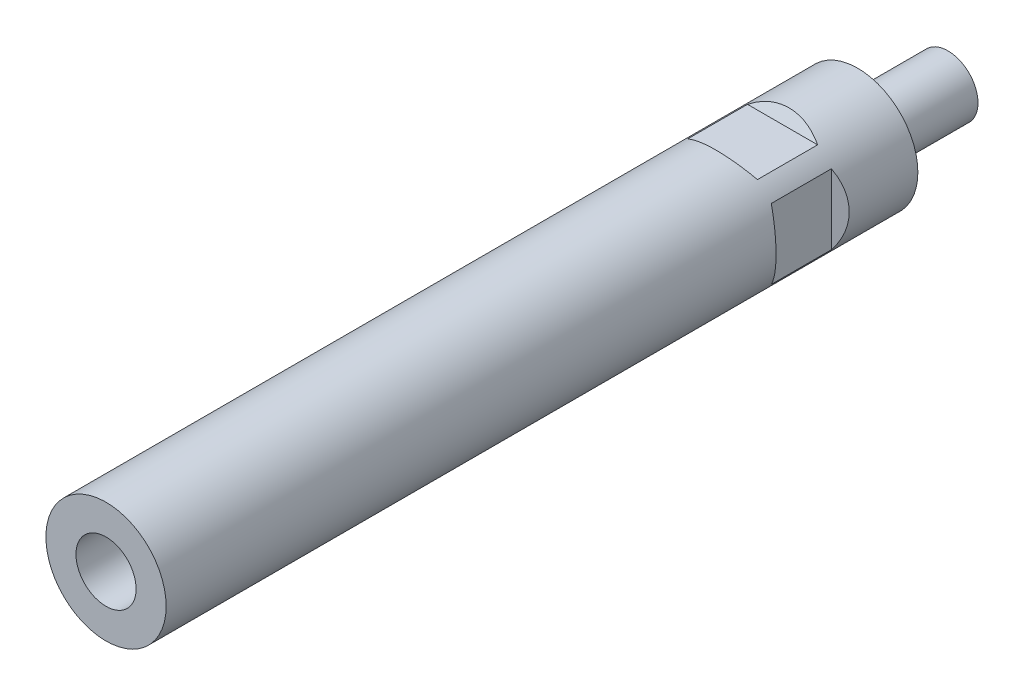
ISO-10303-21;
HEADER;
FILE_DESCRIPTION(('STEP AP214'),'2;1');
FILE_NAME('part.step','',(''),(''),'','','');
FILE_SCHEMA(('AUTOMOTIVE_DESIGN { 1 0 10303 214 1 1 1 1 }'));
ENDSEC;
DATA;
#1=APPLICATION_CONTEXT('core data for automotive mechanical design processes');
#2=APPLICATION_PROTOCOL_DEFINITION('international standard','automotive_design',2000,#1);
#3=PRODUCT_CONTEXT('',#1,'mechanical');
#4=PRODUCT('Part','Part','',(#3));
#5=PRODUCT_RELATED_PRODUCT_CATEGORY('part','',(#4));
#6=PRODUCT_DEFINITION_FORMATION('','',#4);
#7=PRODUCT_DEFINITION_CONTEXT('part definition',#1,'design');
#8=PRODUCT_DEFINITION('design','',#6,#7);
#9=PRODUCT_DEFINITION_SHAPE('','',#8);
#10=(LENGTH_UNIT() NAMED_UNIT(*) SI_UNIT(.MILLI.,.METRE.));
#11=(NAMED_UNIT(*) PLANE_ANGLE_UNIT() SI_UNIT($,.RADIAN.));
#12=(NAMED_UNIT(*) SI_UNIT($,.STERADIAN.) SOLID_ANGLE_UNIT());
#13=UNCERTAINTY_MEASURE_WITH_UNIT(LENGTH_MEASURE(1.E-05),#10,'distance_accuracy_value','');
#14=(GEOMETRIC_REPRESENTATION_CONTEXT(3) GLOBAL_UNCERTAINTY_ASSIGNED_CONTEXT((#13)) GLOBAL_UNIT_ASSIGNED_CONTEXT((#10,
#11,#12)) REPRESENTATION_CONTEXT('',''));
#15=CARTESIAN_POINT('',(0.,0.,0.));
#16=DIRECTION('',(0.,0.,1.));
#17=DIRECTION('',(1.,0.,0.));
#18=AXIS2_PLACEMENT_3D('',#15,#16,#17);
#19=CARTESIAN_POINT('',(0.,0.,8.));
#20=DIRECTION('',(0.,0.,1.));
#21=DIRECTION('',(0.,-1.,0.));
#22=AXIS2_PLACEMENT_3D('',#19,#20,#21);
#23=CYLINDRICAL_SURFACE('',#22,4.);
#24=CARTESIAN_POINT('',(0.,0.,-12.));
#25=DIRECTION('',(0.,0.,1.));
#26=DIRECTION('',(0.,-1.,0.));
#27=AXIS2_PLACEMENT_3D('',#24,#25,#26);
#28=CIRCLE('',#27,4.);
#29=CARTESIAN_POINT('',(0.,-4.,-12.));
#30=VERTEX_POINT('',#29);
#31=EDGE_CURVE('E22',#30,#30,#28,.F.);
#32=ORIENTED_EDGE('',*,*,#31,.F.);
#33=EDGE_LOOP('',(#32));
#34=FACE_BOUND('',#33,.T.);
#35=CARTESIAN_POINT('',(0.,0.,0.));
#36=DIRECTION('',(0.,0.,1.));
#37=DIRECTION('',(1.,0.,0.));
#38=AXIS2_PLACEMENT_3D('',#35,#36,#37);
#39=CIRCLE('',#38,4.);
#40=CARTESIAN_POINT('',(4.,0.,0.));
#41=VERTEX_POINT('',#40);
#42=EDGE_CURVE('E9',#41,#41,#39,.T.);
#43=ORIENTED_EDGE('',*,*,#42,.F.);
#44=EDGE_LOOP('',(#43));
#45=FACE_BOUND('',#44,.T.);
#46=ADVANCED_FACE('F14',(#34,#45),#23,.T.);
#47=CARTESIAN_POINT('',(0.,0.,-12.));
#48=DIRECTION('',(0.,0.,1.));
#49=DIRECTION('',(0.,-1.,0.));
#50=AXIS2_PLACEMENT_3D('',#47,#48,#49);
#51=PLANE('',#50);
#52=ORIENTED_EDGE('',*,*,#31,.T.);
#53=EDGE_LOOP('',(#52));
#54=FACE_BOUND('',#53,.T.);
#55=ADVANCED_FACE('F16',(#54),#51,.F.);
#56=CARTESIAN_POINT('',(3.4,0.,80.));
#57=DIRECTION('',(0.,0.,-1.));
#58=DIRECTION('',(-1.,0.,0.));
#59=AXIS2_PLACEMENT_3D('',#56,#57,#58);
#60=PLANE('',#59);
#61=CARTESIAN_POINT('',(0.,0.,80.));
#62=DIRECTION('',(0.,0.,1.));
#63=DIRECTION('',(1.,0.,0.));
#64=AXIS2_PLACEMENT_3D('',#61,#62,#63);
#65=CIRCLE('',#64,4.);
#66=CARTESIAN_POINT('',(4.,0.,80.));
#67=VERTEX_POINT('',#66);
#68=EDGE_CURVE('E251',#67,#67,#65,.T.);
#69=ORIENTED_EDGE('',*,*,#68,.T.);
#70=EDGE_LOOP('',(#69));
#71=FACE_BOUND('',#70,.T.);
#72=ADVANCED_FACE('F125',(#71),#60,.F.);
#73=CARTESIAN_POINT('',(0.,0.,100.));
#74=DIRECTION('',(0.,0.,1.));
#75=DIRECTION('',(1.,0.,0.));
#76=AXIS2_PLACEMENT_3D('',#73,#74,#75);
#77=CYLINDRICAL_SURFACE('',#76,4.);
#78=ORIENTED_EDGE('',*,*,#68,.F.);
#79=EDGE_LOOP('',(#78));
#80=FACE_BOUND('',#79,.T.);
#81=CARTESIAN_POINT('',(0.,0.,100.));
#82=DIRECTION('',(0.,0.,1.));
#83=DIRECTION('',(1.,0.,0.));
#84=AXIS2_PLACEMENT_3D('',#81,#82,#83);
#85=CIRCLE('',#84,4.);
#86=CARTESIAN_POINT('',(4.,0.,100.));
#87=VERTEX_POINT('',#86);
#88=EDGE_CURVE('E96',#87,#87,#85,.T.);
#89=ORIENTED_EDGE('',*,*,#88,.T.);
#90=EDGE_LOOP('',(#89));
#91=FACE_BOUND('',#90,.T.);
#92=ADVANCED_FACE('F127',(#80,#91),#77,.F.);
#93=CARTESIAN_POINT('',(0.,0.,100.));
#94=DIRECTION('',(0.,0.,1.));
#95=DIRECTION('',(1.,0.,0.));
#96=AXIS2_PLACEMENT_3D('',#93,#94,#95);
#97=PLANE('',#96);
#98=ORIENTED_EDGE('',*,*,#88,.F.);
#99=EDGE_LOOP('',(#98));
#100=FACE_BOUND('',#99,.T.);
#101=CARTESIAN_POINT('',(0.,0.,100.));
#102=DIRECTION('',(0.,0.,1.));
#103=DIRECTION('',(1.,0.,0.));
#104=AXIS2_PLACEMENT_3D('',#101,#102,#103);
#105=CIRCLE('',#104,8.);
#106=CARTESIAN_POINT('',(8.,0.,100.));
#107=VERTEX_POINT('',#106);
#108=EDGE_CURVE('E239',#107,#107,#105,.T.);
#109=ORIENTED_EDGE('',*,*,#108,.T.);
#110=EDGE_LOOP('',(#109));
#111=FACE_BOUND('',#110,.T.);
#112=ADVANCED_FACE('F134',(#100,#111),#97,.T.);
#113=CARTESIAN_POINT('',(6.5,-8.,18.));
#114=DIRECTION('',(-0.5,0.,0.866025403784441));
#115=DIRECTION('',(0.866025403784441,0.,0.5));
#116=AXIS2_PLACEMENT_3D('',#113,#114,#115);
#117=PLANE('',#116);
#118=DIRECTION('',(0.,1.,0.));
#119=VECTOR('',#118,1.);
#120=CARTESIAN_POINT('',(6.5,-8.,18.));
#121=LINE('',#120,#119);
#122=CARTESIAN_POINT('',(6.5,-4.6636895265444,18.));
#123=VERTEX_POINT('',#122);
#124=CARTESIAN_POINT('',(6.5,4.6636895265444,18.));
#125=VERTEX_POINT('',#124);
#126=EDGE_CURVE('E183',#123,#125,#121,.T.);
#127=ORIENTED_EDGE('',*,*,#126,.T.);
#128=CARTESIAN_POINT('',(0.,0.,14.2472232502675));
#129=DIRECTION('',(-0.5,0.,0.866025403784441));
#130=DIRECTION('',(-0.866025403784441,0.,-0.5));
#131=AXIS2_PLACEMENT_3D('',#128,#129,#130);
#132=ELLIPSE('',#131,9.23760430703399,8.);
#133=EDGE_CURVE('E35',#123,#125,#132,.T.);
#134=ORIENTED_EDGE('',*,*,#133,.F.);
#135=EDGE_LOOP('',(#127,#134));
#136=FACE_BOUND('',#135,.T.);
#137=ADVANCED_FACE('F175',(#136),#117,.F.);
#138=CARTESIAN_POINT('',(6.5,-8.,18.));
#139=DIRECTION('',(-1.,0.,0.));
#140=DIRECTION('',(0.,0.,1.));
#141=AXIS2_PLACEMENT_3D('',#138,#139,#140);
#142=PLANE('',#141);
#143=ORIENTED_EDGE('',*,*,#126,.F.);
#144=DIRECTION('',(0.,0.,-1.));
#145=VECTOR('',#144,1.);
#146=CARTESIAN_POINT('',(6.5,-4.6636895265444,100.));
#147=LINE('',#146,#145);
#148=CARTESIAN_POINT('',(6.5,-4.66368952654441,10.));
#149=VERTEX_POINT('',#148);
#150=EDGE_CURVE('E191',#149,#123,#147,.F.);
#151=ORIENTED_EDGE('',*,*,#150,.F.);
#152=DIRECTION('',(0.,1.,0.));
#153=VECTOR('',#152,1.);
#154=CARTESIAN_POINT('',(6.5,-8.,10.));
#155=LINE('',#154,#153);
#156=CARTESIAN_POINT('',(6.5,4.6636895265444,10.));
#157=VERTEX_POINT('',#156);
#158=EDGE_CURVE('E187',#149,#157,#155,.T.);
#159=ORIENTED_EDGE('',*,*,#158,.T.);
#160=DIRECTION('',(0.,0.,-1.));
#161=VECTOR('',#160,1.);
#162=CARTESIAN_POINT('',(6.5,4.6636895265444,100.));
#163=LINE('',#162,#161);
#164=EDGE_CURVE('E29',#125,#157,#163,.T.);
#165=ORIENTED_EDGE('',*,*,#164,.F.);
#166=EDGE_LOOP('',(#143,#151,#159,#165));
#167=FACE_BOUND('',#166,.T.);
#168=ADVANCED_FACE('F172',(#167),#142,.F.);
#169=CARTESIAN_POINT('',(6.5,-8.,10.));
#170=DIRECTION('',(-0.5,0.,-0.866025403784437));
#171=DIRECTION('',(-0.866025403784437,0.,0.5));
#172=AXIS2_PLACEMENT_3D('',#169,#170,#171);
#173=PLANE('',#172);
#174=CARTESIAN_POINT('',(0.,0.,13.7527767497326));
#175=DIRECTION('',(-0.5,0.,-0.866025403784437));
#176=DIRECTION('',(0.866025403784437,0.,-0.5));
#177=AXIS2_PLACEMENT_3D('',#174,#175,#176);
#178=ELLIPSE('',#177,9.23760430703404,8.);
#179=EDGE_CURVE('E195',#157,#149,#178,.T.);
#180=ORIENTED_EDGE('',*,*,#179,.F.);
#181=ORIENTED_EDGE('',*,*,#158,.F.);
#182=EDGE_LOOP('',(#180,#181));
#183=FACE_BOUND('',#182,.T.);
#184=ADVANCED_FACE('F167',(#183),#173,.F.);
#185=CARTESIAN_POINT('',(-6.5,-8.,10.));
#186=DIRECTION('',(0.5,0.,-0.866025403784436));
#187=DIRECTION('',(-0.866025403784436,0.,-0.5));
#188=AXIS2_PLACEMENT_3D('',#185,#186,#187);
#189=PLANE('',#188);
#190=CARTESIAN_POINT('',(0.,0.,13.7527767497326));
#191=DIRECTION('',(0.5,0.,-0.866025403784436));
#192=DIRECTION('',(-0.866025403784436,0.,-0.5));
#193=AXIS2_PLACEMENT_3D('',#190,#191,#192);
#194=ELLIPSE('',#193,9.23760430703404,8.);
#195=CARTESIAN_POINT('',(-6.5,-4.6636895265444,10.));
#196=VERTEX_POINT('',#195);
#197=CARTESIAN_POINT('',(-6.5,4.6636895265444,10.));
#198=VERTEX_POINT('',#197);
#199=EDGE_CURVE('E193',#196,#198,#194,.T.);
#200=ORIENTED_EDGE('',*,*,#199,.F.);
#201=DIRECTION('',(0.,1.,0.));
#202=VECTOR('',#201,1.);
#203=CARTESIAN_POINT('',(-6.5,-8.,10.));
#204=LINE('',#203,#202);
#205=EDGE_CURVE('E227',#196,#198,#204,.T.);
#206=ORIENTED_EDGE('',*,*,#205,.T.);
#207=EDGE_LOOP('',(#200,#206));
#208=FACE_BOUND('',#207,.T.);
#209=ADVANCED_FACE('F163',(#208),#189,.F.);
#210=CARTESIAN_POINT('',(-6.5,-8.,18.));
#211=DIRECTION('',(0.5,0.,0.86602540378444));
#212=DIRECTION('',(0.86602540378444,0.,-0.5));
#213=AXIS2_PLACEMENT_3D('',#210,#211,#212);
#214=PLANE('',#213);
#215=DIRECTION('',(0.,1.,0.));
#216=VECTOR('',#215,1.);
#217=CARTESIAN_POINT('',(-6.5,-8.,18.));
#218=LINE('',#217,#216);
#219=CARTESIAN_POINT('',(-6.5,-4.66368952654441,18.));
#220=VERTEX_POINT('',#219);
#221=CARTESIAN_POINT('',(-6.5,4.6636895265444,18.));
#222=VERTEX_POINT('',#221);
#223=EDGE_CURVE('E231',#220,#222,#218,.T.);
#224=ORIENTED_EDGE('',*,*,#223,.F.);
#225=CARTESIAN_POINT('',(0.,0.,14.2472232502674));
#226=DIRECTION('',(0.5,0.,0.86602540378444));
#227=DIRECTION('',(0.86602540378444,0.,-0.5));
#228=AXIS2_PLACEMENT_3D('',#225,#226,#227);
#229=ELLIPSE('',#228,9.237604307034,8.);
#230=EDGE_CURVE('E206',#222,#220,#229,.T.);
#231=ORIENTED_EDGE('',*,*,#230,.F.);
#232=EDGE_LOOP('',(#224,#231));
#233=FACE_BOUND('',#232,.T.);
#234=ADVANCED_FACE('F160',(#233),#214,.F.);
#235=CARTESIAN_POINT('',(-6.5,-8.,18.));
#236=DIRECTION('',(1.,0.,0.));
#237=DIRECTION('',(0.,0.,-1.));
#238=AXIS2_PLACEMENT_3D('',#235,#236,#237);
#239=PLANE('',#238);
#240=ORIENTED_EDGE('',*,*,#223,.T.);
#241=DIRECTION('',(0.,0.,-1.));
#242=VECTOR('',#241,1.);
#243=CARTESIAN_POINT('',(-6.5,4.66368952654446,100.));
#244=LINE('',#243,#242);
#245=EDGE_CURVE('E200',#198,#222,#244,.F.);
#246=ORIENTED_EDGE('',*,*,#245,.F.);
#247=ORIENTED_EDGE('',*,*,#205,.F.);
#248=DIRECTION('',(0.,0.,-1.));
#249=VECTOR('',#248,1.);
#250=CARTESIAN_POINT('',(-6.5,-4.66368952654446,100.));
#251=LINE('',#250,#249);
#252=EDGE_CURVE('E203',#220,#196,#251,.T.);
#253=ORIENTED_EDGE('',*,*,#252,.F.);
#254=EDGE_LOOP('',(#240,#246,#247,#253));
#255=FACE_BOUND('',#254,.T.);
#256=ADVANCED_FACE('F158',(#255),#239,.F.);
#257=CARTESIAN_POINT('',(8.,6.5,18.));
#258=DIRECTION('',(0.,-0.5,0.86602540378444));
#259=DIRECTION('',(0.,-0.866025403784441,-0.5));
#260=AXIS2_PLACEMENT_3D('',#257,#258,#259);
#261=PLANE('',#260);
#262=DIRECTION('',(-1.,0.,0.));
#263=VECTOR('',#262,1.);
#264=CARTESIAN_POINT('',(8.,6.5,18.));
#265=LINE('',#264,#263);
#266=CARTESIAN_POINT('',(4.66368952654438,6.5,18.));
#267=VERTEX_POINT('',#266);
#268=CARTESIAN_POINT('',(-4.66368952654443,6.5,18.));
#269=VERTEX_POINT('',#268);
#270=EDGE_CURVE('E225',#267,#269,#265,.T.);
#271=ORIENTED_EDGE('',*,*,#270,.T.);
#272=CARTESIAN_POINT('',(0.,0.,14.2472232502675));
#273=DIRECTION('',(0.,-0.5,0.86602540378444));
#274=DIRECTION('',(0.,-0.866025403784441,-0.5));
#275=AXIS2_PLACEMENT_3D('',#272,#273,#274);
#276=ELLIPSE('',#275,9.237604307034,8.);
#277=EDGE_CURVE('E214',#267,#269,#276,.T.);
#278=ORIENTED_EDGE('',*,*,#277,.F.);
#279=EDGE_LOOP('',(#271,#278));
#280=FACE_BOUND('',#279,.T.);
#281=ADVANCED_FACE('F151',(#280),#261,.F.);
#282=CARTESIAN_POINT('',(8.,6.5,18.));
#283=DIRECTION('',(0.,-1.,0.));
#284=DIRECTION('',(1.,0.,0.));
#285=AXIS2_PLACEMENT_3D('',#282,#283,#284);
#286=PLANE('',#285);
#287=ORIENTED_EDGE('',*,*,#270,.F.);
#288=DIRECTION('',(0.,0.,-1.));
#289=VECTOR('',#288,1.);
#290=CARTESIAN_POINT('',(4.66368952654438,6.5,100.));
#291=LINE('',#290,#289);
#292=CARTESIAN_POINT('',(4.66368952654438,6.5,10.));
#293=VERTEX_POINT('',#292);
#294=EDGE_CURVE('E88',#293,#267,#291,.F.);
#295=ORIENTED_EDGE('',*,*,#294,.F.);
#296=DIRECTION('',(-1.,0.,0.));
#297=VECTOR('',#296,1.);
#298=CARTESIAN_POINT('',(8.,6.5,10.));
#299=LINE('',#298,#297);
#300=CARTESIAN_POINT('',(-4.66368952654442,6.5,10.));
#301=VERTEX_POINT('',#300);
#302=EDGE_CURVE('E223',#293,#301,#299,.T.);
#303=ORIENTED_EDGE('',*,*,#302,.T.);
#304=DIRECTION('',(0.,0.,-1.));
#305=VECTOR('',#304,1.);
#306=CARTESIAN_POINT('',(-4.66368952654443,6.5,100.));
#307=LINE('',#306,#305);
#308=EDGE_CURVE('E211',#269,#301,#307,.T.);
#309=ORIENTED_EDGE('',*,*,#308,.F.);
#310=EDGE_LOOP('',(#287,#295,#303,#309));
#311=FACE_BOUND('',#310,.T.);
#312=ADVANCED_FACE('F148',(#311),#286,.F.);
#313=CARTESIAN_POINT('',(8.,6.5,10.));
#314=DIRECTION('',(0.,-0.5,-0.866025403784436));
#315=DIRECTION('',(0.,0.866025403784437,-0.5));
#316=AXIS2_PLACEMENT_3D('',#313,#314,#315);
#317=PLANE('',#316);
#318=CARTESIAN_POINT('',(0.,0.,13.7527767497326));
#319=DIRECTION('',(0.,-0.5,-0.866025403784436));
#320=DIRECTION('',(0.,0.866025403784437,-0.5));
#321=AXIS2_PLACEMENT_3D('',#318,#319,#320);
#322=ELLIPSE('',#321,9.23760430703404,8.);
#323=EDGE_CURVE('E209',#301,#293,#322,.T.);
#324=ORIENTED_EDGE('',*,*,#323,.F.);
#325=ORIENTED_EDGE('',*,*,#302,.F.);
#326=EDGE_LOOP('',(#324,#325));
#327=FACE_BOUND('',#326,.T.);
#328=ADVANCED_FACE('F145',(#327),#317,.F.);
#329=CARTESIAN_POINT('',(8.,-6.5,10.));
#330=DIRECTION('',(0.,0.5,-0.866025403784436));
#331=DIRECTION('',(0.,0.866025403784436,0.5));
#332=AXIS2_PLACEMENT_3D('',#329,#330,#331);
#333=PLANE('',#332);
#334=CARTESIAN_POINT('',(0.,0.,13.7527767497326));
#335=DIRECTION('',(0.,0.5,-0.866025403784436));
#336=DIRECTION('',(0.,-0.866025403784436,-0.5));
#337=AXIS2_PLACEMENT_3D('',#334,#335,#336);
#338=ELLIPSE('',#337,9.23760430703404,8.);
#339=CARTESIAN_POINT('',(4.66368952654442,-6.5,10.));
#340=VERTEX_POINT('',#339);
#341=CARTESIAN_POINT('',(-4.66368952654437,-6.5,10.));
#342=VERTEX_POINT('',#341);
#343=EDGE_CURVE('E79',#340,#342,#338,.T.);
#344=ORIENTED_EDGE('',*,*,#343,.F.);
#345=DIRECTION('',(-1.,0.,0.));
#346=VECTOR('',#345,1.);
#347=CARTESIAN_POINT('',(8.,-6.5,10.));
#348=LINE('',#347,#346);
#349=EDGE_CURVE('E82',#340,#342,#348,.T.);
#350=ORIENTED_EDGE('',*,*,#349,.T.);
#351=EDGE_LOOP('',(#344,#350));
#352=FACE_BOUND('',#351,.T.);
#353=ADVANCED_FACE('F81',(#352),#333,.F.);
#354=CARTESIAN_POINT('',(8.,-6.5,18.));
#355=DIRECTION('',(0.,0.5,0.86602540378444));
#356=DIRECTION('',(0.,-0.86602540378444,0.5));
#357=AXIS2_PLACEMENT_3D('',#354,#355,#356);
#358=PLANE('',#357);
#359=DIRECTION('',(-1.,0.,0.));
#360=VECTOR('',#359,1.);
#361=CARTESIAN_POINT('',(8.,-6.5,18.));
#362=LINE('',#361,#360);
#363=CARTESIAN_POINT('',(4.66368952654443,-6.5,18.));
#364=VERTEX_POINT('',#363);
#365=CARTESIAN_POINT('',(-4.66368952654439,-6.5,18.));
#366=VERTEX_POINT('',#365);
#367=EDGE_CURVE('E95',#364,#366,#362,.T.);
#368=ORIENTED_EDGE('',*,*,#367,.F.);
#369=CARTESIAN_POINT('',(0.,0.,14.2472232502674));
#370=DIRECTION('',(0.,0.5,0.86602540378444));
#371=DIRECTION('',(0.,0.86602540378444,-0.5));
#372=AXIS2_PLACEMENT_3D('',#369,#370,#371);
#373=ELLIPSE('',#372,9.237604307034,8.);
#374=EDGE_CURVE('E101',#366,#364,#373,.T.);
#375=ORIENTED_EDGE('',*,*,#374,.F.);
#376=EDGE_LOOP('',(#368,#375));
#377=FACE_BOUND('',#376,.T.);
#378=ADVANCED_FACE('F139',(#377),#358,.F.);
#379=CARTESIAN_POINT('',(8.,-6.5,18.));
#380=DIRECTION('',(0.,1.,0.));
#381=DIRECTION('',(-1.,0.,0.));
#382=AXIS2_PLACEMENT_3D('',#379,#380,#381);
#383=PLANE('',#382);
#384=ORIENTED_EDGE('',*,*,#367,.T.);
#385=DIRECTION('',(0.,0.,-1.));
#386=VECTOR('',#385,1.);
#387=CARTESIAN_POINT('',(-4.66368952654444,-6.5,100.));
#388=LINE('',#387,#386);
#389=EDGE_CURVE('E87',#342,#366,#388,.F.);
#390=ORIENTED_EDGE('',*,*,#389,.F.);
#391=ORIENTED_EDGE('',*,*,#349,.F.);
#392=DIRECTION('',(0.,0.,-1.));
#393=VECTOR('',#392,1.);
#394=CARTESIAN_POINT('',(4.66368952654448,-6.5,100.));
#395=LINE('',#394,#393);
#396=EDGE_CURVE('E93',#364,#340,#395,.T.);
#397=ORIENTED_EDGE('',*,*,#396,.F.);
#398=EDGE_LOOP('',(#384,#390,#391,#397));
#399=FACE_BOUND('',#398,.T.);
#400=ADVANCED_FACE('F92',(#399),#383,.F.);
#401=CARTESIAN_POINT('',(0.,0.,100.));
#402=DIRECTION('',(0.,0.,-1.));
#403=DIRECTION('',(-1.,0.,0.));
#404=AXIS2_PLACEMENT_3D('',#401,#402,#403);
#405=CYLINDRICAL_SURFACE('',#404,8.);
#406=ORIENTED_EDGE('',*,*,#389,.T.);
#407=ORIENTED_EDGE('',*,*,#374,.T.);
#408=ORIENTED_EDGE('',*,*,#396,.T.);
#409=ORIENTED_EDGE('',*,*,#343,.T.);
#410=EDGE_LOOP('',(#406,#407,#408,#409));
#411=FACE_BOUND('',#410,.T.);
#412=ORIENTED_EDGE('',*,*,#323,.T.);
#413=ORIENTED_EDGE('',*,*,#294,.T.);
#414=ORIENTED_EDGE('',*,*,#277,.T.);
#415=ORIENTED_EDGE('',*,*,#308,.T.);
#416=EDGE_LOOP('',(#412,#413,#414,#415));
#417=FACE_BOUND('',#416,.T.);
#418=ORIENTED_EDGE('',*,*,#245,.T.);
#419=ORIENTED_EDGE('',*,*,#230,.T.);
#420=ORIENTED_EDGE('',*,*,#252,.T.);
#421=ORIENTED_EDGE('',*,*,#199,.T.);
#422=EDGE_LOOP('',(#418,#419,#420,#421));
#423=FACE_BOUND('',#422,.T.);
#424=ORIENTED_EDGE('',*,*,#179,.T.);
#425=ORIENTED_EDGE('',*,*,#150,.T.);
#426=ORIENTED_EDGE('',*,*,#133,.T.);
#427=ORIENTED_EDGE('',*,*,#164,.T.);
#428=EDGE_LOOP('',(#424,#425,#426,#427));
#429=FACE_BOUND('',#428,.T.);
#430=ORIENTED_EDGE('',*,*,#108,.F.);
#431=EDGE_LOOP('',(#430));
#432=FACE_BOUND('',#431,.T.);
#433=CARTESIAN_POINT('',(0.,0.,0.));
#434=DIRECTION('',(0.,0.,1.));
#435=DIRECTION('',(1.,0.,0.));
#436=AXIS2_PLACEMENT_3D('',#433,#434,#435);
#437=CIRCLE('',#436,8.);
#438=CARTESIAN_POINT('',(8.,0.,0.));
#439=VERTEX_POINT('',#438);
#440=EDGE_CURVE('E186',#439,#439,#437,.T.);
#441=ORIENTED_EDGE('',*,*,#440,.T.);
#442=EDGE_LOOP('',(#441));
#443=FACE_BOUND('',#442,.T.);
#444=ADVANCED_FACE('F99',(#411,#417,#423,#429,#432,#443),#405,.T.);
#445=CARTESIAN_POINT('',(0.,0.,0.));
#446=DIRECTION('',(0.,0.,1.));
#447=DIRECTION('',(1.,0.,0.));
#448=AXIS2_PLACEMENT_3D('',#445,#446,#447);
#449=PLANE('',#448);
#450=ORIENTED_EDGE('',*,*,#440,.F.);
#451=EDGE_LOOP('',(#450));
#452=FACE_BOUND('',#451,.T.);
#453=ORIENTED_EDGE('',*,*,#42,.T.);
#454=EDGE_LOOP('',(#453));
#455=FACE_BOUND('',#454,.T.);
#456=ADVANCED_FACE('F111',(#452,#455),#449,.F.);
#457=CLOSED_SHELL('',(#46,#55,#72,#92,#112,#137,#168,#184,#209,#234,#256,#281,#312,#328,#353,
#378,#400,#444,#456));
#458=MANIFOLD_SOLID_BREP('B1',#457);
#459=ADVANCED_BREP_SHAPE_REPRESENTATION('',(#18,#458),#14);
#460=SHAPE_DEFINITION_REPRESENTATION(#9,#459);
ENDSEC;
END-ISO-10303-21;
